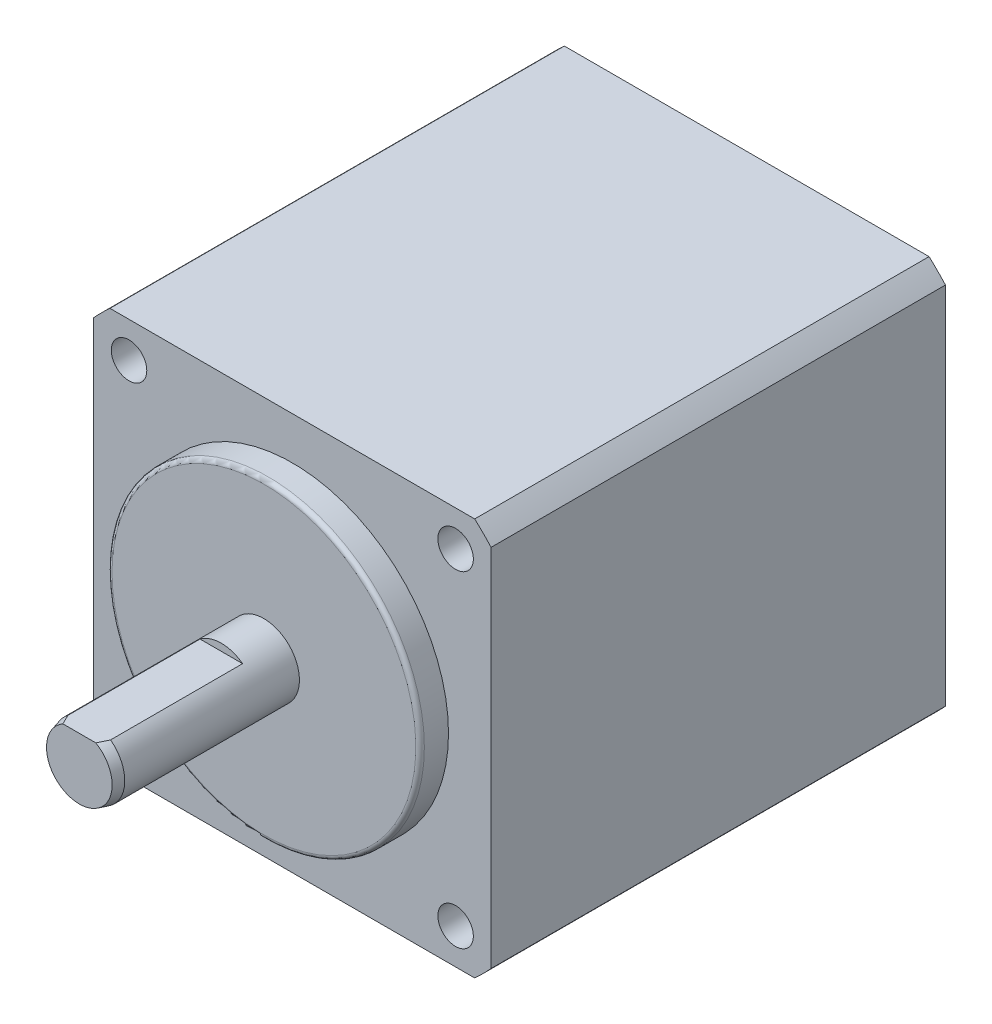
ISO-10303-21;
HEADER;
FILE_DESCRIPTION(('STEP AP214'),'2;1');
FILE_NAME('part.step','',(''),(''),'','','');
FILE_SCHEMA(('AUTOMOTIVE_DESIGN { 1 0 10303 214 1 1 1 1 }'));
ENDSEC;
DATA;
#1=APPLICATION_CONTEXT('core data for automotive mechanical design processes');
#2=APPLICATION_PROTOCOL_DEFINITION('international standard','automotive_design',2000,#1);
#3=PRODUCT_CONTEXT('',#1,'mechanical');
#4=PRODUCT('Part','Part','',(#3));
#5=PRODUCT_RELATED_PRODUCT_CATEGORY('part','',(#4));
#6=PRODUCT_DEFINITION_FORMATION('','',#4);
#7=PRODUCT_DEFINITION_CONTEXT('part definition',#1,'design');
#8=PRODUCT_DEFINITION('design','',#6,#7);
#9=PRODUCT_DEFINITION_SHAPE('','',#8);
#10=(LENGTH_UNIT() NAMED_UNIT(*) SI_UNIT(.MILLI.,.METRE.));
#11=(NAMED_UNIT(*) PLANE_ANGLE_UNIT() SI_UNIT($,.RADIAN.));
#12=(NAMED_UNIT(*) SI_UNIT($,.STERADIAN.) SOLID_ANGLE_UNIT());
#13=UNCERTAINTY_MEASURE_WITH_UNIT(LENGTH_MEASURE(1.E-05),#10,'distance_accuracy_value','');
#14=(GEOMETRIC_REPRESENTATION_CONTEXT(3) GLOBAL_UNCERTAINTY_ASSIGNED_CONTEXT((#13)) GLOBAL_UNIT_ASSIGNED_CONTEXT((#10,
#11,#12)) REPRESENTATION_CONTEXT('',''));
#15=CARTESIAN_POINT('',(0.,0.,0.));
#16=DIRECTION('',(0.,0.,1.));
#17=DIRECTION('',(1.,0.,0.));
#18=AXIS2_PLACEMENT_3D('',#15,#16,#17);
#19=CARTESIAN_POINT('',(-14.,0.,-32.));
#20=DIRECTION('',(1.,0.,0.));
#21=DIRECTION('',(0.,0.,-1.));
#22=AXIS2_PLACEMENT_3D('',#19,#20,#21);
#23=PLANE('',#22);
#24=DIRECTION('',(0.,1.,0.));
#25=VECTOR('',#24,1.);
#26=CARTESIAN_POINT('',(-14.,0.,0.));
#27=LINE('',#26,#25);
#28=CARTESIAN_POINT('',(-14.,-12.8452325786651,0.));
#29=VERTEX_POINT('',#28);
#30=CARTESIAN_POINT('',(-14.,12.8452325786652,0.));
#31=VERTEX_POINT('',#30);
#32=EDGE_CURVE('E162',#29,#31,#27,.T.);
#33=ORIENTED_EDGE('',*,*,#32,.T.);
#34=DIRECTION('',(0.,0.,1.));
#35=VECTOR('',#34,1.);
#36=CARTESIAN_POINT('',(-14.,12.8452325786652,-32.));
#37=LINE('',#36,#35);
#38=CARTESIAN_POINT('',(-14.,12.8452325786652,-32.));
#39=VERTEX_POINT('',#38);
#40=EDGE_CURVE('E12',#39,#31,#37,.T.);
#41=ORIENTED_EDGE('',*,*,#40,.F.);
#42=DIRECTION('',(0.,1.,0.));
#43=VECTOR('',#42,1.);
#44=CARTESIAN_POINT('',(-14.,0.,-32.));
#45=LINE('',#44,#43);
#46=CARTESIAN_POINT('',(-14.,-12.8452325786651,-32.));
#47=VERTEX_POINT('',#46);
#48=EDGE_CURVE('E235',#47,#39,#45,.T.);
#49=ORIENTED_EDGE('',*,*,#48,.F.);
#50=DIRECTION('',(0.,0.,1.));
#51=VECTOR('',#50,1.);
#52=CARTESIAN_POINT('',(-14.,-12.8452325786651,-32.));
#53=LINE('',#52,#51);
#54=EDGE_CURVE('E199',#47,#29,#53,.T.);
#55=ORIENTED_EDGE('',*,*,#54,.T.);
#56=EDGE_LOOP('',(#33,#41,#49,#55));
#57=FACE_BOUND('',#56,.T.);
#58=ADVANCED_FACE('F49',(#57),#23,.F.);
#59=CARTESIAN_POINT('',(0.,0.,-32.));
#60=DIRECTION('',(0.,0.,1.));
#61=DIRECTION('',(1.,0.,0.));
#62=AXIS2_PLACEMENT_3D('',#59,#60,#61);
#63=CYLINDRICAL_SURFACE('',#62,19.);
#64=CARTESIAN_POINT('',(0.,0.,0.));
#65=DIRECTION('',(0.,0.,-1.));
#66=DIRECTION('',(-1.,0.,0.));
#67=AXIS2_PLACEMENT_3D('',#64,#65,#66);
#68=CIRCLE('',#67,19.);
#69=CARTESIAN_POINT('',(-12.8452325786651,14.,0.));
#70=VERTEX_POINT('',#69);
#71=EDGE_CURVE('E165',#31,#70,#68,.T.);
#72=ORIENTED_EDGE('',*,*,#71,.T.);
#73=DIRECTION('',(0.,0.,1.));
#74=VECTOR('',#73,1.);
#75=CARTESIAN_POINT('',(-12.8452325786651,14.,-32.));
#76=LINE('',#75,#74);
#77=CARTESIAN_POINT('',(-12.8452325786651,14.,-32.));
#78=VERTEX_POINT('',#77);
#79=EDGE_CURVE('E58',#78,#70,#76,.T.);
#80=ORIENTED_EDGE('',*,*,#79,.F.);
#81=CARTESIAN_POINT('',(0.,0.,-32.));
#82=DIRECTION('',(0.,0.,-1.));
#83=DIRECTION('',(-1.,0.,0.));
#84=AXIS2_PLACEMENT_3D('',#81,#82,#83);
#85=CIRCLE('',#84,19.);
#86=EDGE_CURVE('E239',#39,#78,#85,.T.);
#87=ORIENTED_EDGE('',*,*,#86,.F.);
#88=ORIENTED_EDGE('',*,*,#40,.T.);
#89=EDGE_LOOP('',(#72,#80,#87,#88));
#90=FACE_BOUND('',#89,.T.);
#91=ADVANCED_FACE('F257',(#90),#63,.T.);
#92=CARTESIAN_POINT('',(0.,14.,-32.));
#93=DIRECTION('',(0.,-1.,0.));
#94=DIRECTION('',(0.,0.,-1.));
#95=AXIS2_PLACEMENT_3D('',#92,#93,#94);
#96=PLANE('',#95);
#97=DIRECTION('',(1.,0.,0.));
#98=VECTOR('',#97,1.);
#99=CARTESIAN_POINT('',(0.,14.,0.));
#100=LINE('',#99,#98);
#101=CARTESIAN_POINT('',(12.8452325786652,14.,0.));
#102=VERTEX_POINT('',#101);
#103=EDGE_CURVE('E188',#70,#102,#100,.T.);
#104=ORIENTED_EDGE('',*,*,#103,.T.);
#105=DIRECTION('',(0.,0.,1.));
#106=VECTOR('',#105,1.);
#107=CARTESIAN_POINT('',(12.8452325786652,14.,-32.));
#108=LINE('',#107,#106);
#109=CARTESIAN_POINT('',(12.8452325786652,14.,-32.));
#110=VERTEX_POINT('',#109);
#111=EDGE_CURVE('E211',#110,#102,#108,.T.);
#112=ORIENTED_EDGE('',*,*,#111,.F.);
#113=DIRECTION('',(1.,0.,0.));
#114=VECTOR('',#113,1.);
#115=CARTESIAN_POINT('',(0.,14.,-32.));
#116=LINE('',#115,#114);
#117=EDGE_CURVE('E221',#78,#110,#116,.T.);
#118=ORIENTED_EDGE('',*,*,#117,.F.);
#119=ORIENTED_EDGE('',*,*,#79,.T.);
#120=EDGE_LOOP('',(#104,#112,#118,#119));
#121=FACE_BOUND('',#120,.T.);
#122=ADVANCED_FACE('F219',(#121),#96,.F.);
#123=CARTESIAN_POINT('',(14.,12.8452325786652,0.));
#124=VERTEX_POINT('',#123);
#125=EDGE_CURVE('E190',#102,#124,#68,.T.);
#126=ORIENTED_EDGE('',*,*,#125,.T.);
#127=DIRECTION('',(0.,0.,1.));
#128=VECTOR('',#127,1.);
#129=CARTESIAN_POINT('',(14.,12.8452325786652,-32.));
#130=LINE('',#129,#128);
#131=CARTESIAN_POINT('',(14.,12.8452325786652,-32.));
#132=VERTEX_POINT('',#131);
#133=EDGE_CURVE('E209',#132,#124,#130,.T.);
#134=ORIENTED_EDGE('',*,*,#133,.F.);
#135=EDGE_CURVE('E244',#110,#132,#85,.T.);
#136=ORIENTED_EDGE('',*,*,#135,.F.);
#137=ORIENTED_EDGE('',*,*,#111,.T.);
#138=EDGE_LOOP('',(#126,#134,#136,#137));
#139=FACE_BOUND('',#138,.T.);
#140=ADVANCED_FACE('F260',(#139),#63,.T.);
#141=CARTESIAN_POINT('',(14.,0.,-32.));
#142=DIRECTION('',(1.,0.,0.));
#143=DIRECTION('',(0.,0.,-1.));
#144=AXIS2_PLACEMENT_3D('',#141,#142,#143);
#145=PLANE('',#144);
#146=DIRECTION('',(0.,1.,0.));
#147=VECTOR('',#146,1.);
#148=CARTESIAN_POINT('',(14.,0.,0.));
#149=LINE('',#148,#147);
#150=CARTESIAN_POINT('',(14.,-12.8452325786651,0.));
#151=VERTEX_POINT('',#150);
#152=EDGE_CURVE('E192',#151,#124,#149,.T.);
#153=ORIENTED_EDGE('',*,*,#152,.F.);
#154=DIRECTION('',(0.,0.,1.));
#155=VECTOR('',#154,1.);
#156=CARTESIAN_POINT('',(14.,-12.8452325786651,-32.));
#157=LINE('',#156,#155);
#158=CARTESIAN_POINT('',(14.,-12.8452325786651,-32.));
#159=VERTEX_POINT('',#158);
#160=EDGE_CURVE('E207',#159,#151,#157,.T.);
#161=ORIENTED_EDGE('',*,*,#160,.F.);
#162=DIRECTION('',(0.,1.,0.));
#163=VECTOR('',#162,1.);
#164=CARTESIAN_POINT('',(14.,0.,-32.));
#165=LINE('',#164,#163);
#166=EDGE_CURVE('E183',#159,#132,#165,.T.);
#167=ORIENTED_EDGE('',*,*,#166,.T.);
#168=ORIENTED_EDGE('',*,*,#133,.T.);
#169=EDGE_LOOP('',(#153,#161,#167,#168));
#170=FACE_BOUND('',#169,.T.);
#171=ADVANCED_FACE('F268',(#170),#145,.T.);
#172=CARTESIAN_POINT('',(12.8452325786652,-14.,0.));
#173=VERTEX_POINT('',#172);
#174=EDGE_CURVE('E195',#151,#173,#68,.T.);
#175=ORIENTED_EDGE('',*,*,#174,.T.);
#176=DIRECTION('',(0.,0.,1.));
#177=VECTOR('',#176,1.);
#178=CARTESIAN_POINT('',(12.8452325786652,-14.,-32.));
#179=LINE('',#178,#177);
#180=CARTESIAN_POINT('',(12.8452325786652,-14.,-32.));
#181=VERTEX_POINT('',#180);
#182=EDGE_CURVE('E205',#181,#173,#179,.T.);
#183=ORIENTED_EDGE('',*,*,#182,.F.);
#184=EDGE_CURVE('E180',#159,#181,#85,.T.);
#185=ORIENTED_EDGE('',*,*,#184,.F.);
#186=ORIENTED_EDGE('',*,*,#160,.T.);
#187=EDGE_LOOP('',(#175,#183,#185,#186));
#188=FACE_BOUND('',#187,.T.);
#189=ADVANCED_FACE('F269',(#188),#63,.T.);
#190=CARTESIAN_POINT('',(0.,-14.,-32.));
#191=DIRECTION('',(0.,-1.,0.));
#192=DIRECTION('',(0.,0.,-1.));
#193=AXIS2_PLACEMENT_3D('',#190,#191,#192);
#194=PLANE('',#193);
#195=DIRECTION('',(0.,0.,-1.));
#196=VECTOR('',#195,1.);
#197=CARTESIAN_POINT('',(-7.6,-14.,-32.));
#198=LINE('',#197,#196);
#199=CARTESIAN_POINT('',(-7.6,-14.,-22.5));
#200=VERTEX_POINT('',#199);
#201=CARTESIAN_POINT('',(-7.6,-14.,-32.));
#202=VERTEX_POINT('',#201);
#203=EDGE_CURVE('E52',#200,#202,#198,.T.);
#204=ORIENTED_EDGE('',*,*,#203,.F.);
#205=DIRECTION('',(-1.,0.,0.));
#206=VECTOR('',#205,1.);
#207=CARTESIAN_POINT('',(-7.6,-14.,-22.5));
#208=LINE('',#207,#206);
#209=CARTESIAN_POINT('',(7.6,-14.,-22.5));
#210=VERTEX_POINT('',#209);
#211=EDGE_CURVE('E159',#210,#200,#208,.T.);
#212=ORIENTED_EDGE('',*,*,#211,.F.);
#213=DIRECTION('',(0.,0.,1.));
#214=VECTOR('',#213,1.);
#215=CARTESIAN_POINT('',(7.6,-14.,-32.));
#216=LINE('',#215,#214);
#217=CARTESIAN_POINT('',(7.6,-14.,-32.));
#218=VERTEX_POINT('',#217);
#219=EDGE_CURVE('E71',#218,#210,#216,.T.);
#220=ORIENTED_EDGE('',*,*,#219,.F.);
#221=DIRECTION('',(1.,0.,0.));
#222=VECTOR('',#221,1.);
#223=CARTESIAN_POINT('',(0.,-14.,-32.));
#224=LINE('',#223,#222);
#225=EDGE_CURVE('E176',#218,#181,#224,.T.);
#226=ORIENTED_EDGE('',*,*,#225,.T.);
#227=ORIENTED_EDGE('',*,*,#182,.T.);
#228=DIRECTION('',(1.,0.,0.));
#229=VECTOR('',#228,1.);
#230=CARTESIAN_POINT('',(0.,-14.,0.));
#231=LINE('',#230,#229);
#232=CARTESIAN_POINT('',(-12.8452325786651,-14.,0.));
#233=VERTEX_POINT('',#232);
#234=EDGE_CURVE('E196',#233,#173,#231,.T.);
#235=ORIENTED_EDGE('',*,*,#234,.F.);
#236=DIRECTION('',(0.,0.,1.));
#237=VECTOR('',#236,1.);
#238=CARTESIAN_POINT('',(-12.8452325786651,-14.,-32.));
#239=LINE('',#238,#237);
#240=CARTESIAN_POINT('',(-12.8452325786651,-14.,-32.));
#241=VERTEX_POINT('',#240);
#242=EDGE_CURVE('E202',#241,#233,#239,.T.);
#243=ORIENTED_EDGE('',*,*,#242,.F.);
#244=EDGE_CURVE('E179',#241,#202,#224,.T.);
#245=ORIENTED_EDGE('',*,*,#244,.T.);
#246=EDGE_LOOP('',(#204,#212,#220,#226,#227,#235,#243,#245));
#247=FACE_BOUND('',#246,.T.);
#248=ADVANCED_FACE('F253',(#247),#194,.T.);
#249=EDGE_CURVE('E189',#233,#29,#68,.T.);
#250=ORIENTED_EDGE('',*,*,#249,.T.);
#251=ORIENTED_EDGE('',*,*,#54,.F.);
#252=EDGE_CURVE('E203',#241,#47,#85,.T.);
#253=ORIENTED_EDGE('',*,*,#252,.F.);
#254=ORIENTED_EDGE('',*,*,#242,.T.);
#255=EDGE_LOOP('',(#250,#251,#253,#254));
#256=FACE_BOUND('',#255,.T.);
#257=ADVANCED_FACE('F255',(#256),#63,.T.);
#258=CARTESIAN_POINT('',(0.,0.,-32.));
#259=DIRECTION('',(0.,0.,-1.));
#260=DIRECTION('',(-1.,0.,0.));
#261=AXIS2_PLACEMENT_3D('',#258,#259,#260);
#262=PLANE('',#261);
#263=ORIENTED_EDGE('',*,*,#48,.T.);
#264=ORIENTED_EDGE('',*,*,#86,.T.);
#265=ORIENTED_EDGE('',*,*,#117,.T.);
#266=ORIENTED_EDGE('',*,*,#135,.T.);
#267=ORIENTED_EDGE('',*,*,#166,.F.);
#268=ORIENTED_EDGE('',*,*,#184,.T.);
#269=ORIENTED_EDGE('',*,*,#225,.F.);
#270=DIRECTION('',(0.,1.,0.));
#271=VECTOR('',#270,1.);
#272=CARTESIAN_POINT('',(7.6,-19.,-32.));
#273=LINE('',#272,#271);
#274=CARTESIAN_POINT('',(7.6,-19.,-32.));
#275=VERTEX_POINT('',#274);
#276=EDGE_CURVE('E146',#275,#218,#273,.T.);
#277=ORIENTED_EDGE('',*,*,#276,.F.);
#278=DIRECTION('',(1.,0.,0.));
#279=VECTOR('',#278,1.);
#280=CARTESIAN_POINT('',(-7.6,-19.,-32.));
#281=LINE('',#280,#279);
#282=CARTESIAN_POINT('',(-7.6,-19.,-32.));
#283=VERTEX_POINT('',#282);
#284=EDGE_CURVE('E138',#283,#275,#281,.T.);
#285=ORIENTED_EDGE('',*,*,#284,.F.);
#286=DIRECTION('',(0.,1.,0.));
#287=VECTOR('',#286,1.);
#288=CARTESIAN_POINT('',(-7.6,-19.,-32.));
#289=LINE('',#288,#287);
#290=EDGE_CURVE('E144',#283,#202,#289,.T.);
#291=ORIENTED_EDGE('',*,*,#290,.T.);
#292=ORIENTED_EDGE('',*,*,#244,.F.);
#293=ORIENTED_EDGE('',*,*,#252,.T.);
#294=EDGE_LOOP('',(#263,#264,#265,#266,#267,#268,#269,#277,#285,#291,#292,#293));
#295=FACE_BOUND('',#294,.T.);
#296=ADVANCED_FACE('F141',(#295),#262,.T.);
#297=CARTESIAN_POINT('',(0.,0.,0.));
#298=DIRECTION('',(0.,0.,-1.));
#299=DIRECTION('',(-1.,0.,0.));
#300=AXIS2_PLACEMENT_3D('',#297,#298,#299);
#301=PLANE('',#300);
#302=CARTESIAN_POINT('',(11.5,-11.5,0.));
#303=DIRECTION('',(0.,0.,1.));
#304=DIRECTION('',(1.,0.,0.));
#305=AXIS2_PLACEMENT_3D('',#302,#303,#304);
#306=CIRCLE('',#305,1.25);
#307=CARTESIAN_POINT('',(12.75,-11.5,0.));
#308=VERTEX_POINT('',#307);
#309=EDGE_CURVE('E314',#308,#308,#306,.T.);
#310=ORIENTED_EDGE('',*,*,#309,.F.);
#311=EDGE_LOOP('',(#310));
#312=FACE_BOUND('',#311,.T.);
#313=CARTESIAN_POINT('',(-11.5,-11.5,0.));
#314=DIRECTION('',(0.,0.,1.));
#315=DIRECTION('',(1.,0.,0.));
#316=AXIS2_PLACEMENT_3D('',#313,#314,#315);
#317=CIRCLE('',#316,1.25);
#318=CARTESIAN_POINT('',(-10.25,-11.5,0.));
#319=VERTEX_POINT('',#318);
#320=EDGE_CURVE('E318',#319,#319,#317,.T.);
#321=ORIENTED_EDGE('',*,*,#320,.F.);
#322=EDGE_LOOP('',(#321));
#323=FACE_BOUND('',#322,.T.);
#324=CARTESIAN_POINT('',(11.5,11.5,0.));
#325=DIRECTION('',(0.,0.,1.));
#326=DIRECTION('',(1.,0.,0.));
#327=AXIS2_PLACEMENT_3D('',#324,#325,#326);
#328=CIRCLE('',#327,1.25);
#329=CARTESIAN_POINT('',(12.75,11.5,0.));
#330=VERTEX_POINT('',#329);
#331=EDGE_CURVE('E322',#330,#330,#328,.T.);
#332=ORIENTED_EDGE('',*,*,#331,.F.);
#333=EDGE_LOOP('',(#332));
#334=FACE_BOUND('',#333,.T.);
#335=CARTESIAN_POINT('',(-11.5,11.5,0.));
#336=DIRECTION('',(0.,0.,1.));
#337=DIRECTION('',(1.,0.,0.));
#338=AXIS2_PLACEMENT_3D('',#335,#336,#337);
#339=CIRCLE('',#338,1.25);
#340=CARTESIAN_POINT('',(-10.25,11.5,0.));
#341=VERTEX_POINT('',#340);
#342=EDGE_CURVE('E325',#341,#341,#339,.T.);
#343=ORIENTED_EDGE('',*,*,#342,.F.);
#344=EDGE_LOOP('',(#343));
#345=FACE_BOUND('',#344,.T.);
#346=ORIENTED_EDGE('',*,*,#32,.F.);
#347=ORIENTED_EDGE('',*,*,#249,.F.);
#348=ORIENTED_EDGE('',*,*,#234,.T.);
#349=ORIENTED_EDGE('',*,*,#174,.F.);
#350=ORIENTED_EDGE('',*,*,#152,.T.);
#351=ORIENTED_EDGE('',*,*,#125,.F.);
#352=ORIENTED_EDGE('',*,*,#103,.F.);
#353=ORIENTED_EDGE('',*,*,#71,.F.);
#354=EDGE_LOOP('',(#346,#347,#348,#349,#350,#351,#352,#353));
#355=FACE_BOUND('',#354,.T.);
#356=ADVANCED_FACE('F226',(#312,#323,#334,#345,#355),#301,.F.);
#357=CARTESIAN_POINT('',(-7.6,-19.,-32.));
#358=DIRECTION('',(1.,0.,0.));
#359=DIRECTION('',(0.,0.,-1.));
#360=AXIS2_PLACEMENT_3D('',#357,#358,#359);
#361=PLANE('',#360);
#362=ORIENTED_EDGE('',*,*,#203,.T.);
#363=ORIENTED_EDGE('',*,*,#290,.F.);
#364=DIRECTION('',(0.,0.,-1.));
#365=VECTOR('',#364,1.);
#366=CARTESIAN_POINT('',(-7.6,-19.,-32.));
#367=LINE('',#366,#365);
#368=CARTESIAN_POINT('',(-7.6,-19.,-22.5));
#369=VERTEX_POINT('',#368);
#370=EDGE_CURVE('E150',#369,#283,#367,.T.);
#371=ORIENTED_EDGE('',*,*,#370,.F.);
#372=DIRECTION('',(0.,1.,0.));
#373=VECTOR('',#372,1.);
#374=CARTESIAN_POINT('',(-7.6,-19.,-22.5));
#375=LINE('',#374,#373);
#376=EDGE_CURVE('E289',#369,#200,#375,.T.);
#377=ORIENTED_EDGE('',*,*,#376,.T.);
#378=EDGE_LOOP('',(#362,#363,#371,#377));
#379=FACE_BOUND('',#378,.T.);
#380=ADVANCED_FACE('F161',(#379),#361,.F.);
#381=CARTESIAN_POINT('',(7.6,-19.,-32.));
#382=DIRECTION('',(-1.,0.,0.));
#383=DIRECTION('',(0.,0.,1.));
#384=AXIS2_PLACEMENT_3D('',#381,#382,#383);
#385=PLANE('',#384);
#386=ORIENTED_EDGE('',*,*,#219,.T.);
#387=DIRECTION('',(0.,1.,0.));
#388=VECTOR('',#387,1.);
#389=CARTESIAN_POINT('',(7.6,-19.,-22.5));
#390=LINE('',#389,#388);
#391=CARTESIAN_POINT('',(7.6,-19.,-22.5));
#392=VERTEX_POINT('',#391);
#393=EDGE_CURVE('E167',#392,#210,#390,.T.);
#394=ORIENTED_EDGE('',*,*,#393,.F.);
#395=DIRECTION('',(0.,0.,1.));
#396=VECTOR('',#395,1.);
#397=CARTESIAN_POINT('',(7.6,-19.,-32.));
#398=LINE('',#397,#396);
#399=EDGE_CURVE('E149',#275,#392,#398,.T.);
#400=ORIENTED_EDGE('',*,*,#399,.F.);
#401=ORIENTED_EDGE('',*,*,#276,.T.);
#402=EDGE_LOOP('',(#386,#394,#400,#401));
#403=FACE_BOUND('',#402,.T.);
#404=ADVANCED_FACE('F285',(#403),#385,.F.);
#405=CARTESIAN_POINT('',(-7.6,-19.,-22.5));
#406=DIRECTION('',(0.,0.,-1.));
#407=DIRECTION('',(-1.,0.,0.));
#408=AXIS2_PLACEMENT_3D('',#405,#406,#407);
#409=PLANE('',#408);
#410=ORIENTED_EDGE('',*,*,#211,.T.);
#411=ORIENTED_EDGE('',*,*,#376,.F.);
#412=DIRECTION('',(-1.,0.,0.));
#413=VECTOR('',#412,1.);
#414=CARTESIAN_POINT('',(-7.6,-19.,-22.5));
#415=LINE('',#414,#413);
#416=EDGE_CURVE('E155',#392,#369,#415,.T.);
#417=ORIENTED_EDGE('',*,*,#416,.F.);
#418=ORIENTED_EDGE('',*,*,#393,.T.);
#419=EDGE_LOOP('',(#410,#411,#417,#418));
#420=FACE_BOUND('',#419,.T.);
#421=ADVANCED_FACE('F294',(#420),#409,.F.);
#422=CARTESIAN_POINT('',(0.,-19.,0.));
#423=DIRECTION('',(0.,1.,0.));
#424=DIRECTION('',(0.,0.,1.));
#425=AXIS2_PLACEMENT_3D('',#422,#423,#424);
#426=PLANE('',#425);
#427=ORIENTED_EDGE('',*,*,#370,.T.);
#428=ORIENTED_EDGE('',*,*,#284,.T.);
#429=ORIENTED_EDGE('',*,*,#399,.T.);
#430=ORIENTED_EDGE('',*,*,#416,.T.);
#431=EDGE_LOOP('',(#427,#428,#429,#430));
#432=FACE_BOUND('',#431,.T.);
#433=ADVANCED_FACE('F153',(#432),#426,.F.);
#434=CARTESIAN_POINT('',(-11.5,11.5,-4.5));
#435=DIRECTION('',(0.,0.,1.));
#436=DIRECTION('',(1.,0.,0.));
#437=AXIS2_PLACEMENT_3D('',#434,#435,#436);
#438=CYLINDRICAL_SURFACE('',#437,1.25);
#439=CARTESIAN_POINT('',(-11.5,11.5,-4.5));
#440=DIRECTION('',(0.,0.,1.));
#441=DIRECTION('',(1.,0.,0.));
#442=AXIS2_PLACEMENT_3D('',#439,#440,#441);
#443=CIRCLE('',#442,1.25);
#444=CARTESIAN_POINT('',(-10.25,11.5,-4.5));
#445=VERTEX_POINT('',#444);
#446=EDGE_CURVE('E327',#445,#445,#443,.T.);
#447=ORIENTED_EDGE('',*,*,#446,.F.);
#448=EDGE_LOOP('',(#447));
#449=FACE_BOUND('',#448,.T.);
#450=ORIENTED_EDGE('',*,*,#342,.T.);
#451=EDGE_LOOP('',(#450));
#452=FACE_BOUND('',#451,.T.);
#453=ADVANCED_FACE('F301',(#449,#452),#438,.F.);
#454=CARTESIAN_POINT('',(-11.5,11.5,-4.5));
#455=DIRECTION('',(0.,0.,1.));
#456=DIRECTION('',(1.,0.,0.));
#457=AXIS2_PLACEMENT_3D('',#454,#455,#456);
#458=PLANE('',#457);
#459=ORIENTED_EDGE('',*,*,#446,.T.);
#460=EDGE_LOOP('',(#459));
#461=FACE_BOUND('',#460,.T.);
#462=ADVANCED_FACE('F371',(#461),#458,.T.);
#463=CARTESIAN_POINT('',(11.5,11.5,-4.5));
#464=DIRECTION('',(0.,0.,1.));
#465=DIRECTION('',(1.,0.,0.));
#466=AXIS2_PLACEMENT_3D('',#463,#464,#465);
#467=CYLINDRICAL_SURFACE('',#466,1.25);
#468=CARTESIAN_POINT('',(11.5,11.5,-4.5));
#469=DIRECTION('',(0.,0.,1.));
#470=DIRECTION('',(1.,0.,0.));
#471=AXIS2_PLACEMENT_3D('',#468,#469,#470);
#472=CIRCLE('',#471,1.25);
#473=CARTESIAN_POINT('',(12.75,11.5,-4.5));
#474=VERTEX_POINT('',#473);
#475=EDGE_CURVE('E328',#474,#474,#472,.T.);
#476=ORIENTED_EDGE('',*,*,#475,.F.);
#477=EDGE_LOOP('',(#476));
#478=FACE_BOUND('',#477,.T.);
#479=ORIENTED_EDGE('',*,*,#331,.T.);
#480=EDGE_LOOP('',(#479));
#481=FACE_BOUND('',#480,.T.);
#482=ADVANCED_FACE('F367',(#478,#481),#467,.F.);
#483=CARTESIAN_POINT('',(11.5,11.5,-4.5));
#484=DIRECTION('',(0.,0.,1.));
#485=DIRECTION('',(1.,0.,0.));
#486=AXIS2_PLACEMENT_3D('',#483,#484,#485);
#487=PLANE('',#486);
#488=ORIENTED_EDGE('',*,*,#475,.T.);
#489=EDGE_LOOP('',(#488));
#490=FACE_BOUND('',#489,.T.);
#491=ADVANCED_FACE('F363',(#490),#487,.T.);
#492=CARTESIAN_POINT('',(-11.5,-11.5,-4.5));
#493=DIRECTION('',(0.,0.,1.));
#494=DIRECTION('',(1.,0.,0.));
#495=AXIS2_PLACEMENT_3D('',#492,#493,#494);
#496=CYLINDRICAL_SURFACE('',#495,1.25);
#497=CARTESIAN_POINT('',(-11.5,-11.5,-4.5));
#498=DIRECTION('',(0.,0.,1.));
#499=DIRECTION('',(1.,0.,0.));
#500=AXIS2_PLACEMENT_3D('',#497,#498,#499);
#501=CIRCLE('',#500,1.25);
#502=CARTESIAN_POINT('',(-10.25,-11.5,-4.5));
#503=VERTEX_POINT('',#502);
#504=EDGE_CURVE('E335',#503,#503,#501,.T.);
#505=ORIENTED_EDGE('',*,*,#504,.F.);
#506=EDGE_LOOP('',(#505));
#507=FACE_BOUND('',#506,.T.);
#508=ORIENTED_EDGE('',*,*,#320,.T.);
#509=EDGE_LOOP('',(#508));
#510=FACE_BOUND('',#509,.T.);
#511=ADVANCED_FACE('F357',(#507,#510),#496,.F.);
#512=CARTESIAN_POINT('',(-11.5,-11.5,-4.5));
#513=DIRECTION('',(0.,0.,1.));
#514=DIRECTION('',(1.,0.,0.));
#515=AXIS2_PLACEMENT_3D('',#512,#513,#514);
#516=PLANE('',#515);
#517=ORIENTED_EDGE('',*,*,#504,.T.);
#518=EDGE_LOOP('',(#517));
#519=FACE_BOUND('',#518,.T.);
#520=ADVANCED_FACE('F350',(#519),#516,.T.);
#521=CARTESIAN_POINT('',(11.5,-11.5,-4.5));
#522=DIRECTION('',(0.,0.,1.));
#523=DIRECTION('',(1.,0.,0.));
#524=AXIS2_PLACEMENT_3D('',#521,#522,#523);
#525=CYLINDRICAL_SURFACE('',#524,1.25);
#526=CARTESIAN_POINT('',(11.5,-11.5,-4.5));
#527=DIRECTION('',(0.,0.,1.));
#528=DIRECTION('',(1.,0.,0.));
#529=AXIS2_PLACEMENT_3D('',#526,#527,#528);
#530=CIRCLE('',#529,1.25);
#531=CARTESIAN_POINT('',(12.75,-11.5,-4.5));
#532=VERTEX_POINT('',#531);
#533=EDGE_CURVE('E338',#532,#532,#530,.T.);
#534=ORIENTED_EDGE('',*,*,#533,.F.);
#535=EDGE_LOOP('',(#534));
#536=FACE_BOUND('',#535,.T.);
#537=ORIENTED_EDGE('',*,*,#309,.T.);
#538=EDGE_LOOP('',(#537));
#539=FACE_BOUND('',#538,.T.);
#540=ADVANCED_FACE('F347',(#536,#539),#525,.F.);
#541=CARTESIAN_POINT('',(11.5,-11.5,-4.5));
#542=DIRECTION('',(0.,0.,1.));
#543=DIRECTION('',(1.,0.,0.));
#544=AXIS2_PLACEMENT_3D('',#541,#542,#543);
#545=PLANE('',#544);
#546=ORIENTED_EDGE('',*,*,#533,.T.);
#547=EDGE_LOOP('',(#546));
#548=FACE_BOUND('',#547,.T.);
#549=ADVANCED_FACE('F345',(#548),#545,.T.);
#550=CLOSED_SHELL('',(#58,#91,#122,#140,#171,#189,#248,#257,#296,#356,#380,#404,#421,#433,#453,
#462,#482,#491,#511,#520,#540,#549));
#551=MANIFOLD_SOLID_BREP('B2',#550);
#552=CARTESIAN_POINT('',(0.,0.,15.));
#553=DIRECTION('',(0.,0.,-1.));
#554=DIRECTION('',(-1.,0.,0.));
#555=AXIS2_PLACEMENT_3D('',#552,#553,#554);
#556=CYLINDRICAL_SURFACE('',#555,2.5);
#557=DIRECTION('',(0.,0.,-1.));
#558=VECTOR('',#557,1.);
#559=CARTESIAN_POINT('',(1.5,2.,15.));
#560=LINE('',#559,#558);
#561=CARTESIAN_POINT('',(1.5,2.,5.));
#562=VERTEX_POINT('',#561);
#563=CARTESIAN_POINT('',(1.5,2.,14.3));
#564=VERTEX_POINT('',#563);
#565=EDGE_CURVE('E546',#562,#564,#560,.F.);
#566=ORIENTED_EDGE('',*,*,#565,.T.);
#567=CARTESIAN_POINT('',(0.,0.,14.3));
#568=DIRECTION('',(0.,0.,1.));
#569=DIRECTION('',(1.,0.,0.));
#570=AXIS2_PLACEMENT_3D('',#567,#568,#569);
#571=CIRCLE('',#570,2.5);
#572=CARTESIAN_POINT('',(-1.5,2.,14.3));
#573=VERTEX_POINT('',#572);
#574=EDGE_CURVE('E521',#564,#573,#571,.F.);
#575=ORIENTED_EDGE('',*,*,#574,.T.);
#576=DIRECTION('',(0.,0.,-1.));
#577=VECTOR('',#576,1.);
#578=CARTESIAN_POINT('',(-1.5,2.,15.));
#579=LINE('',#578,#577);
#580=CARTESIAN_POINT('',(-1.5,2.,5.));
#581=VERTEX_POINT('',#580);
#582=EDGE_CURVE('E539',#573,#581,#579,.T.);
#583=ORIENTED_EDGE('',*,*,#582,.T.);
#584=CARTESIAN_POINT('',(0.,0.,5.));
#585=DIRECTION('',(0.,0.,1.));
#586=DIRECTION('',(1.,0.,0.));
#587=AXIS2_PLACEMENT_3D('',#584,#585,#586);
#588=CIRCLE('',#587,2.5);
#589=EDGE_CURVE('E542',#562,#581,#588,.T.);
#590=ORIENTED_EDGE('',*,*,#589,.F.);
#591=EDGE_LOOP('',(#566,#575,#583,#590));
#592=FACE_BOUND('',#591,.T.);
#593=CARTESIAN_POINT('',(0.,0.,2.));
#594=DIRECTION('',(0.,0.,-1.));
#595=DIRECTION('',(-1.,0.,0.));
#596=AXIS2_PLACEMENT_3D('',#593,#594,#595);
#597=CIRCLE('',#596,2.5);
#598=CARTESIAN_POINT('',(-2.5,0.,2.));
#599=VERTEX_POINT('',#598);
#600=EDGE_CURVE('E561',#599,#599,#597,.T.);
#601=ORIENTED_EDGE('',*,*,#600,.F.);
#602=EDGE_LOOP('',(#601));
#603=FACE_BOUND('',#602,.T.);
#604=ADVANCED_FACE('F506',(#592,#603),#556,.T.);
#605=CARTESIAN_POINT('',(0.,0.,15.));
#606=DIRECTION('',(0.,0.,1.));
#607=DIRECTION('',(1.,0.,0.));
#608=AXIS2_PLACEMENT_3D('',#605,#606,#607);
#609=PLANE('',#608);
#610=DIRECTION('',(1.,0.,0.));
#611=VECTOR('',#610,1.);
#612=CARTESIAN_POINT('',(0.,2.,15.));
#613=LINE('',#612,#611);
#614=CARTESIAN_POINT('',(-1.16075761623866,2.,15.));
#615=VERTEX_POINT('',#614);
#616=CARTESIAN_POINT('',(1.16075761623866,2.,15.));
#617=VERTEX_POINT('',#616);
#618=EDGE_CURVE('E553',#615,#617,#613,.T.);
#619=ORIENTED_EDGE('',*,*,#618,.F.);
#620=CARTESIAN_POINT('',(0.,0.,15.));
#621=DIRECTION('',(0.,0.,1.));
#622=DIRECTION('',(1.,0.,0.));
#623=AXIS2_PLACEMENT_3D('',#620,#621,#622);
#624=CIRCLE('',#623,2.31243556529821);
#625=EDGE_CURVE('E552',#615,#617,#624,.T.);
#626=ORIENTED_EDGE('',*,*,#625,.T.);
#627=EDGE_LOOP('',(#619,#626));
#628=FACE_BOUND('',#627,.T.);
#629=ADVANCED_FACE('F589',(#628),#609,.T.);
#630=CARTESIAN_POINT('',(0.,0.,2.));
#631=DIRECTION('',(0.,0.,-1.));
#632=DIRECTION('',(-1.,0.,0.));
#633=AXIS2_PLACEMENT_3D('',#630,#631,#632);
#634=PLANE('',#633);
#635=CARTESIAN_POINT('',(0.,0.,2.));
#636=DIRECTION('',(0.,0.,-1.));
#637=DIRECTION('',(-1.,0.,0.));
#638=AXIS2_PLACEMENT_3D('',#635,#636,#637);
#639=CIRCLE('',#638,10.7);
#640=CARTESIAN_POINT('',(-10.7,0.,2.));
#641=VERTEX_POINT('',#640);
#642=EDGE_CURVE('E47',#641,#641,#639,.F.);
#643=ORIENTED_EDGE('',*,*,#642,.T.);
#644=EDGE_LOOP('',(#643));
#645=FACE_BOUND('',#644,.T.);
#646=ORIENTED_EDGE('',*,*,#600,.T.);
#647=EDGE_LOOP('',(#646));
#648=FACE_BOUND('',#647,.T.);
#649=ADVANCED_FACE('F584',(#645,#648),#634,.F.);
#650=CARTESIAN_POINT('',(0.,0.,2.));
#651=DIRECTION('',(0.,0.,-1.));
#652=DIRECTION('',(-1.,0.,0.));
#653=AXIS2_PLACEMENT_3D('',#650,#651,#652);
#654=CYLINDRICAL_SURFACE('',#653,11.);
#655=CARTESIAN_POINT('',(0.,0.,1.7));
#656=DIRECTION('',(0.,0.,-1.));
#657=DIRECTION('',(-1.,0.,0.));
#658=AXIS2_PLACEMENT_3D('',#655,#656,#657);
#659=CIRCLE('',#658,11.);
#660=CARTESIAN_POINT('',(-11.,0.,1.7));
#661=VERTEX_POINT('',#660);
#662=EDGE_CURVE('E514',#661,#661,#659,.T.);
#663=ORIENTED_EDGE('',*,*,#662,.T.);
#664=EDGE_LOOP('',(#663));
#665=FACE_BOUND('',#664,.T.);
#666=CARTESIAN_POINT('',(0.,0.,0.));
#667=DIRECTION('',(0.,0.,-1.));
#668=DIRECTION('',(-1.,0.,0.));
#669=AXIS2_PLACEMENT_3D('',#666,#667,#668);
#670=CIRCLE('',#669,11.);
#671=CARTESIAN_POINT('',(-11.,0.,0.));
#672=VERTEX_POINT('',#671);
#673=EDGE_CURVE('E545',#672,#672,#670,.T.);
#674=ORIENTED_EDGE('',*,*,#673,.F.);
#675=EDGE_LOOP('',(#674));
#676=FACE_BOUND('',#675,.T.);
#677=ADVANCED_FACE('F588',(#665,#676),#654,.T.);
#678=CARTESIAN_POINT('',(0.,0.,0.));
#679=DIRECTION('',(0.,0.,1.));
#680=DIRECTION('',(1.,0.,0.));
#681=AXIS2_PLACEMENT_3D('',#678,#679,#680);
#682=PLANE('',#681);
#683=ORIENTED_EDGE('',*,*,#673,.T.);
#684=EDGE_LOOP('',(#683));
#685=FACE_BOUND('',#684,.T.);
#686=ADVANCED_FACE('F593',(#685),#682,.F.);
#687=CARTESIAN_POINT('',(0.,0.,5.));
#688=DIRECTION('',(0.,0.,1.));
#689=DIRECTION('',(1.,0.,0.));
#690=AXIS2_PLACEMENT_3D('',#687,#688,#689);
#691=PLANE('',#690);
#692=ORIENTED_EDGE('',*,*,#589,.T.);
#693=DIRECTION('',(1.,0.,0.));
#694=VECTOR('',#693,1.);
#695=CARTESIAN_POINT('',(-2.53785492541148,2.,5.));
#696=LINE('',#695,#694);
#697=EDGE_CURVE('E551',#581,#562,#696,.T.);
#698=ORIENTED_EDGE('',*,*,#697,.T.);
#699=EDGE_LOOP('',(#692,#698));
#700=FACE_BOUND('',#699,.T.);
#701=ADVANCED_FACE('F550',(#700),#691,.T.);
#702=CARTESIAN_POINT('',(-2.53785492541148,2.,5.));
#703=DIRECTION('',(0.,-1.,0.));
#704=DIRECTION('',(0.,0.,-1.));
#705=AXIS2_PLACEMENT_3D('',#702,#703,#704);
#706=PLANE('',#705);
#707=ORIENTED_EDGE('',*,*,#618,.T.);
#708=CARTESIAN_POINT('',(1.16075761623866,2.,15.));
#709=CARTESIAN_POINT('',(1.19128641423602,2.,14.9427849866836));
#710=CARTESIAN_POINT('',(1.22113150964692,2.,14.8852109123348));
#711=CARTESIAN_POINT('',(1.27963273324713,2.,14.7694828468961));
#712=CARTESIAN_POINT('',(1.30828921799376,2.,14.711329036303));
#713=CARTESIAN_POINT('',(1.36460851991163,2.,14.5945478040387));
#714=CARTESIAN_POINT('',(1.39227138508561,2.,14.535920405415));
#715=CARTESIAN_POINT('',(1.44674461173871,2.,14.4182490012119));
#716=CARTESIAN_POINT('',(1.47355471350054,2.,14.3592048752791));
#717=CARTESIAN_POINT('',(1.5,2.,14.3));
#718=B_SPLINE_CURVE_WITH_KNOTS('',3,(#708,#709,#710,#711,#712,#713,#714,#715,#716,#717),
.UNSPECIFIED.,.F.,.F.,(4,2,2,2,4),(0.,0.194539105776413,0.389019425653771,0.583490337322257,
0.778019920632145),.UNSPECIFIED.);
#719=EDGE_CURVE('E529',#617,#564,#718,.T.);
#720=ORIENTED_EDGE('',*,*,#719,.T.);
#721=ORIENTED_EDGE('',*,*,#565,.F.);
#722=ORIENTED_EDGE('',*,*,#697,.F.);
#723=ORIENTED_EDGE('',*,*,#582,.F.);
#724=CARTESIAN_POINT('',(-1.5,2.,14.3));
#725=CARTESIAN_POINT('',(-1.47355471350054,2.,14.3592048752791));
#726=CARTESIAN_POINT('',(-1.44674461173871,2.,14.4182490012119));
#727=CARTESIAN_POINT('',(-1.39227138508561,2.,14.535920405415));
#728=CARTESIAN_POINT('',(-1.36460851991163,2.,14.5945478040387));
#729=CARTESIAN_POINT('',(-1.30828921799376,2.,14.711329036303));
#730=CARTESIAN_POINT('',(-1.27963273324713,2.,14.7694828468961));
#731=CARTESIAN_POINT('',(-1.22113150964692,2.,14.8852109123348));
#732=CARTESIAN_POINT('',(-1.19128641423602,2.,14.9427849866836));
#733=CARTESIAN_POINT('',(-1.16075761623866,2.,15.));
#734=B_SPLINE_CURVE_WITH_KNOTS('',3,(#724,#725,#726,#727,#728,#729,#730,#731,#732,#733),
.UNSPECIFIED.,.F.,.F.,(4,2,2,2,4),(0.,0.194529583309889,0.389000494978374,0.583480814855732,
0.778019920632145),.UNSPECIFIED.);
#735=EDGE_CURVE('E567',#573,#615,#734,.T.);
#736=ORIENTED_EDGE('',*,*,#735,.T.);
#737=EDGE_LOOP('',(#707,#720,#721,#722,#723,#736));
#738=FACE_BOUND('',#737,.T.);
#739=ADVANCED_FACE('F555',(#738),#706,.F.);
#740=CARTESIAN_POINT('',(0.,0.,15.));
#741=DIRECTION('',(0.,0.,-1.));
#742=DIRECTION('',(-1.,0.,0.));
#743=AXIS2_PLACEMENT_3D('',#740,#741,#742);
#744=CONICAL_SURFACE('',#743,2.31243556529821,0.261799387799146);
#745=ORIENTED_EDGE('',*,*,#735,.F.);
#746=ORIENTED_EDGE('',*,*,#574,.F.);
#747=ORIENTED_EDGE('',*,*,#719,.F.);
#748=ORIENTED_EDGE('',*,*,#625,.F.);
#749=EDGE_LOOP('',(#745,#746,#747,#748));
#750=FACE_BOUND('',#749,.T.);
#751=ADVANCED_FACE('F577',(#750),#744,.T.);
#752=CARTESIAN_POINT('',(0.,0.,1.7));
#753=DIRECTION('',(0.,0.,-1.));
#754=DIRECTION('',(-1.,0.,0.));
#755=AXIS2_PLACEMENT_3D('',#752,#753,#754);
#756=TOROIDAL_SURFACE('',#755,10.7,0.3);
#757=ORIENTED_EDGE('',*,*,#642,.F.);
#758=EDGE_LOOP('',(#757));
#759=FACE_BOUND('',#758,.T.);
#760=ORIENTED_EDGE('',*,*,#662,.F.);
#761=EDGE_LOOP('',(#760));
#762=FACE_BOUND('',#761,.T.);
#763=ADVANCED_FACE('F508',(#759,#762),#756,.T.);
#764=CLOSED_SHELL('',(#604,#629,#649,#677,#686,#701,#739,#751,#763));
#765=MANIFOLD_SOLID_BREP('B6',#764);
#766=ADVANCED_BREP_SHAPE_REPRESENTATION('',(#18,#551,#765),#14);
#767=SHAPE_DEFINITION_REPRESENTATION(#9,#766);
ENDSEC;
END-ISO-10303-21;
